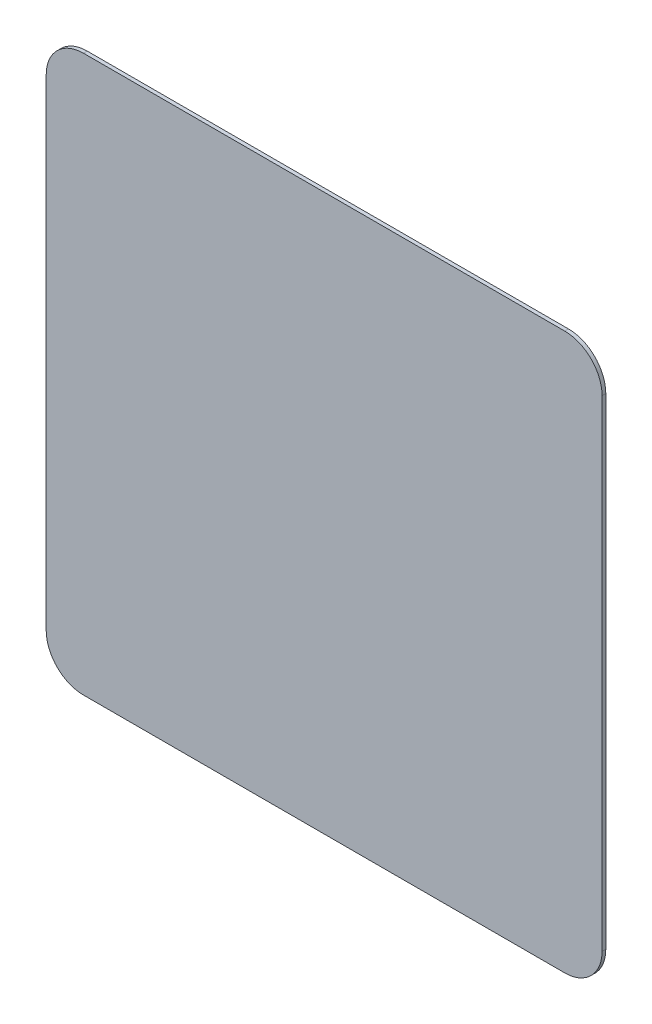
from build123d import *

# Parameters (mm, degrees)
BOSS_EXTRUDE1_DEPTH = 0.4


with BuildPart() as part:
    # Sketch1 → Boss-Extrude1 (new body)
    with BuildSketch(Plane.XY):
        with BuildLine():
            Line((-32.932515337, 19.306134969), (18.667484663, 19.306134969))
            ThreePointArc((18.667484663, 19.306134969), (21.495911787, 18.134562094), (22.667484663, 15.306134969))
            Line((22.667484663, 15.306134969), (22.667484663, -36.293865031))
            ThreePointArc((22.667484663, -36.293865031), (21.495911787, -39.122292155), (18.667484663, -40.293865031))
            Line((18.667484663, -40.293865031), (-32.932515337, -40.293865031))
            ThreePointArc((-32.932515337, -40.293865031), (-35.760942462, -39.122292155), (-36.932515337, -36.293865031))
            Line((-36.932515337, -36.293865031), (-36.932515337, 15.306134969))
            ThreePointArc((-36.932515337, 15.306134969), (-35.760942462, 18.134562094), (-32.932515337, 19.306134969))
        make_face()
    extrude(amount=BOSS_EXTRUDE1_DEPTH)


solid = part.part
